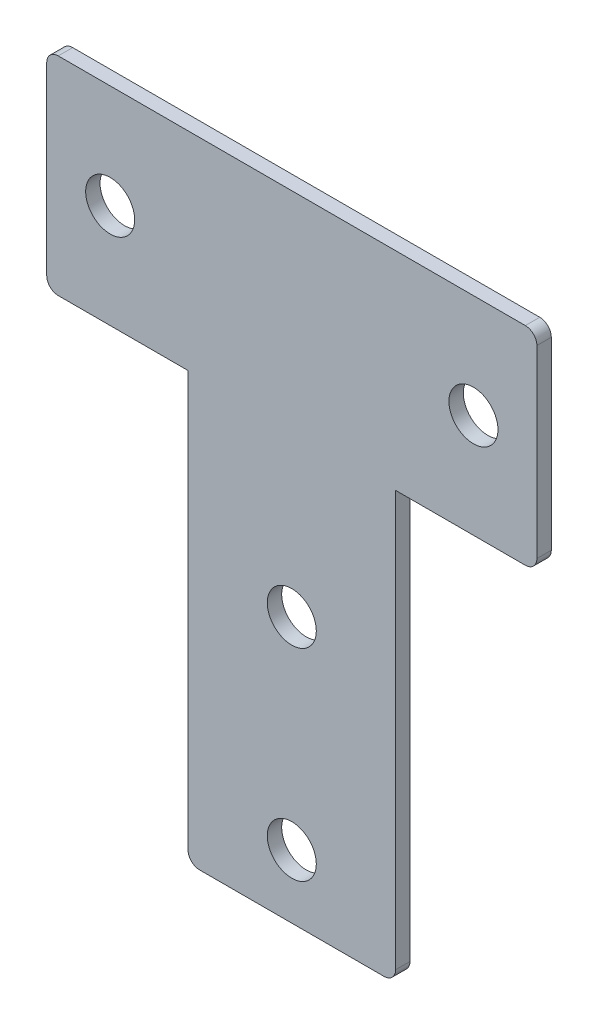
from build123d import *

# Parameters (mm, degrees)
EXTRUDE_1_DEPTH     = 1.25
SKETCH_2_R          = 4.25
CUT_EXTRUDE_1_DEPTH = 2.5
FILLET_1_R          = 2


with BuildPart() as part:
    # Sketch 1 → Extrude 1 (new, symmetric)
    with BuildSketch(Plane.XY):
        Polygon((18, -18), (42.5, -18), (42.5, 18), (-42.5, 18), (-42.5, -18), (-18, -18), (-18, -92), (18, -92), align=None)
    extrude(amount=EXTRUDE_1_DEPTH, both=True)

    # Sketch 2 → Cut-Extrude 1 (cut)
    with BuildSketch(Plane.XY.offset(1.25)):
        with Locations((31.5, 0)):
            Circle(SKETCH_2_R)
        with Locations((0, -81)):
            Circle(SKETCH_2_R)
        with Locations((0, -46)):
            Circle(SKETCH_2_R)
    cut_extrude_1 = extrude(amount=-CUT_EXTRUDE_1_DEPTH, mode=Mode.SUBTRACT)

    # Mirror 1: Cut-Extrude 1 across plane
    add(cut_extrude_1.mirror(Plane(origin=(0, 0, 0), x_dir=(0, 0, 1), z_dir=(1, 0, 0))), mode=Mode.SUBTRACT)

    # Fillet 1
    fillet_1_edges = [part.edges().sort_by_distance(p)[0] for p in [
        (42.5, -18, 0),
        (18, -92, 0),
        (-18, -92, 0),
        (-42.5, -18, 0),
        (-42.5, 18, 0),
        (42.5, 18, 0),
    ]]
    fillet(fillet_1_edges, radius=FILLET_1_R)


solid = part.part
